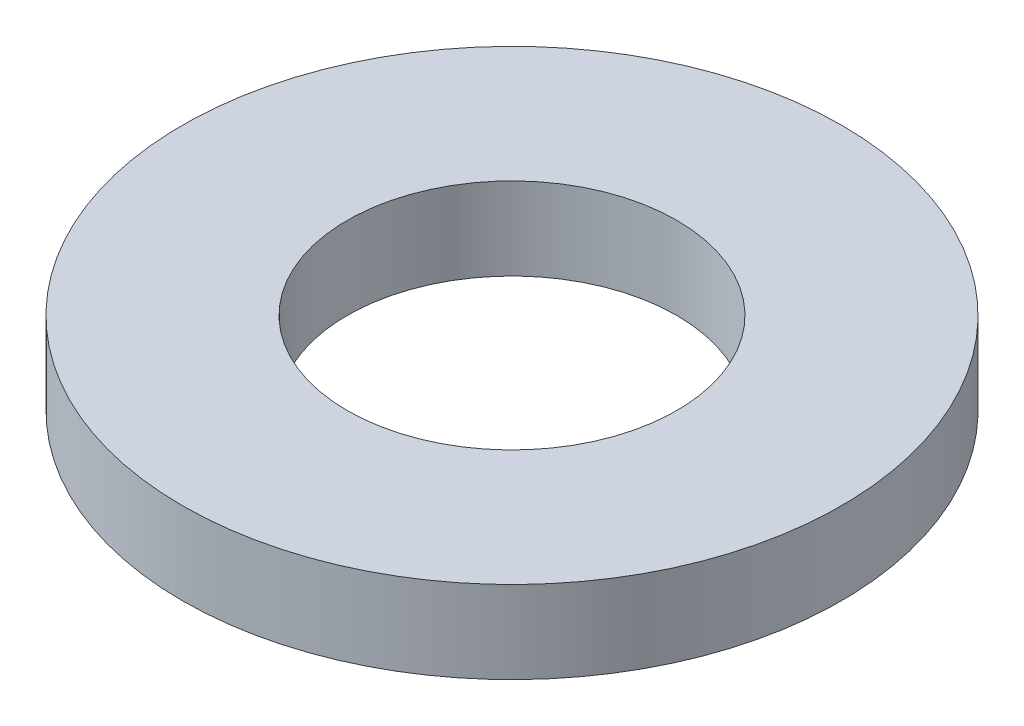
from build123d import *

# Parameters (mm, degrees)
SKETCH1_R           = 2
SKETCH1_R_2         = 1
BOSS_EXTRUDE1_DEPTH = 0.5


with BuildPart() as part:
    # Sketch1 → Boss-Extrude1 (new body)
    with BuildSketch(Plane(origin=(0, 0, 0), x_dir=(1, 0, 0), z_dir=(0, 1, 0))):
        with Locations(Location((0, 0, 0), (0, 0, 270))):
            Circle(SKETCH1_R)
        with Locations(Location((0, 0, 0), (0, 0, 270))):
            Circle(SKETCH1_R_2, mode=Mode.SUBTRACT)
    extrude(amount=BOSS_EXTRUDE1_DEPTH)


solid = part.part
